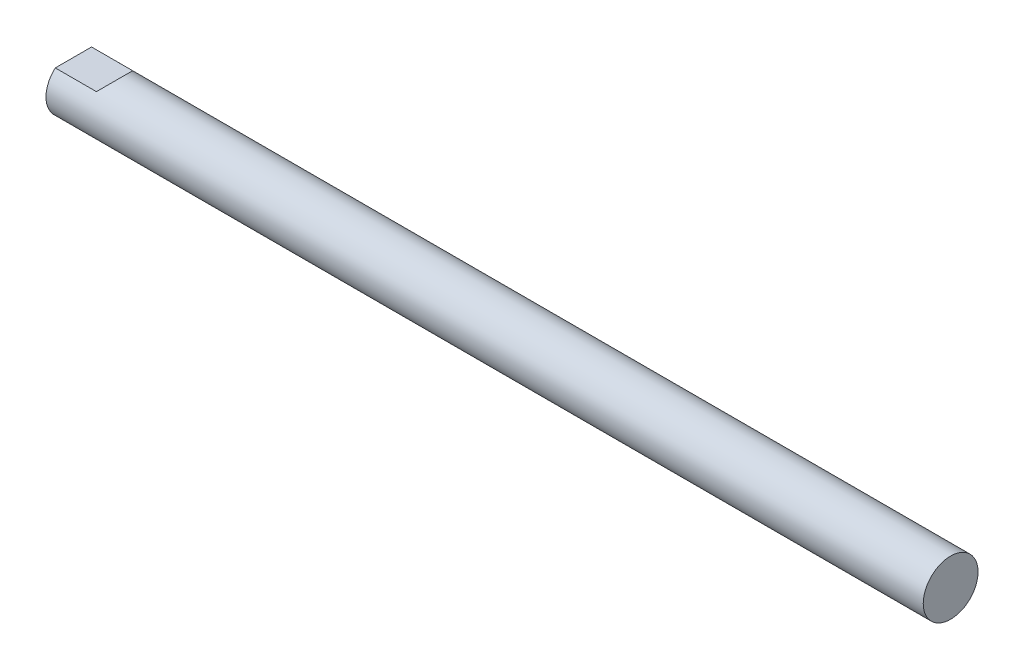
from build123d import *

# Parameters (mm, degrees)
SKETCH1_W                   = 406.4
SKETCH1_H                   = 12.7
F_1_2_13_TAPPED_HOLE1_D     = 10.71626
F_1_2_13_TAPPED_HOLE1_DEPTH = 35.179
F_1_2_13_TAPPED_HOLE1_TIP   = 3.219489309
CUT_EXTRUDE1_DEPTH          = 407.796681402
CUT_EXTRUDE1_DEPTH_BACK     = 407.796681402


with BuildPart() as part:
    # Sketch1 → Revolve1 (revolve)
    with BuildSketch(Plane.XY, mode=Mode.PRIVATE) as revolve1_sk:
        with Locations((203.2, 6.35)):
            Rectangle(SKETCH1_W, SKETCH1_H)
    revolve(revolve1_sk.sketch.rotate(Axis((-29.862162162, 0, 0), (1, 0, 0)), 90), axis=Axis((-29.862162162, 0, 0), (1, 0, 0)))

    # 1_2-13 Tapped Hole1
    with Locations(Plane.ZY):
        with Locations((0, 0)):
            Hole(F_1_2_13_TAPPED_HOLE1_D / 2, depth=F_1_2_13_TAPPED_HOLE1_DEPTH)
            with Locations((0, 0, -(F_1_2_13_TAPPED_HOLE1_DEPTH + F_1_2_13_TAPPED_HOLE1_TIP / 2))):  # 118° drill point
                Cone(0, F_1_2_13_TAPPED_HOLE1_D / 2, F_1_2_13_TAPPED_HOLE1_TIP, mode=Mode.SUBTRACT)

    # Sketch4 → Cut-Extrude1 (cut, two sides: drawn at the far end of the back side and taken through both)
    with BuildSketch(Plane.XY.offset(-CUT_EXTRUDE1_DEPTH_BACK)):
        Polygon((0, 9.525), (19.05, 9.525), (22.225, 12.7), (0, 12.7), align=None)
    extrude(amount=CUT_EXTRUDE1_DEPTH + CUT_EXTRUDE1_DEPTH_BACK, mode=Mode.SUBTRACT)


solid = part.part
